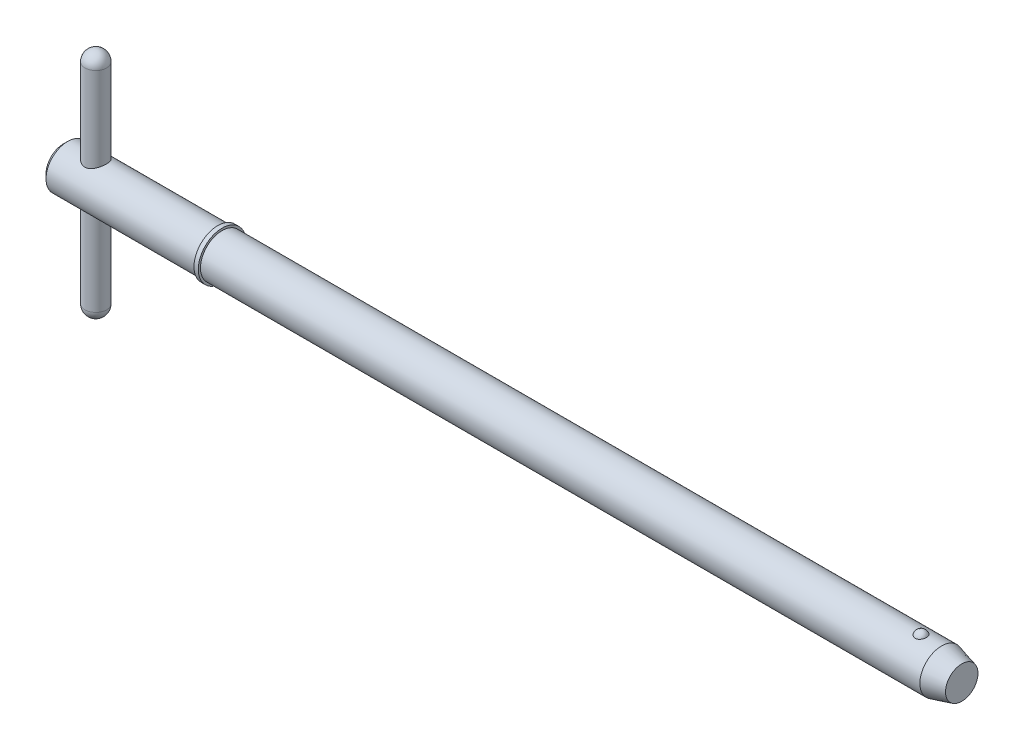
ISO-10303-21;
HEADER;
FILE_DESCRIPTION(('STEP AP214'),'2;1');
FILE_NAME('part.step','',(''),(''),'','','');
FILE_SCHEMA(('AUTOMOTIVE_DESIGN { 1 0 10303 214 1 1 1 1 }'));
ENDSEC;
DATA;
#1=APPLICATION_CONTEXT('core data for automotive mechanical design processes');
#2=APPLICATION_PROTOCOL_DEFINITION('international standard','automotive_design',2000,#1);
#3=PRODUCT_CONTEXT('',#1,'mechanical');
#4=PRODUCT('Part','Part','',(#3));
#5=PRODUCT_RELATED_PRODUCT_CATEGORY('part','',(#4));
#6=PRODUCT_DEFINITION_FORMATION('','',#4);
#7=PRODUCT_DEFINITION_CONTEXT('part definition',#1,'design');
#8=PRODUCT_DEFINITION('design','',#6,#7);
#9=PRODUCT_DEFINITION_SHAPE('','',#8);
#10=(LENGTH_UNIT() NAMED_UNIT(*) SI_UNIT(.MILLI.,.METRE.));
#11=(NAMED_UNIT(*) PLANE_ANGLE_UNIT() SI_UNIT($,.RADIAN.));
#12=(NAMED_UNIT(*) SI_UNIT($,.STERADIAN.) SOLID_ANGLE_UNIT());
#13=UNCERTAINTY_MEASURE_WITH_UNIT(LENGTH_MEASURE(1.E-05),#10,'distance_accuracy_value','');
#14=(GEOMETRIC_REPRESENTATION_CONTEXT(3) GLOBAL_UNCERTAINTY_ASSIGNED_CONTEXT((#13)) GLOBAL_UNIT_ASSIGNED_CONTEXT((#10,
#11,#12)) REPRESENTATION_CONTEXT('',''));
#15=CARTESIAN_POINT('',(0.,0.,0.));
#16=DIRECTION('',(0.,0.,1.));
#17=DIRECTION('',(1.,0.,0.));
#18=AXIS2_PLACEMENT_3D('',#15,#16,#17);
#19=CARTESIAN_POINT('',(3.57,12.7,0.));
#20=DIRECTION('',(0.,-1.,0.));
#21=DIRECTION('',(0.,0.,-1.));
#22=AXIS2_PLACEMENT_3D('',#19,#20,#21);
#23=CYLINDRICAL_SURFACE('',#22,1.19);
#24=CARTESIAN_POINT('',(3.57,-11.51,0.));
#25=DIRECTION('',(0.,-1.,0.));
#26=DIRECTION('',(0.,0.,-1.));
#27=AXIS2_PLACEMENT_3D('',#24,#25,#26);
#28=CIRCLE('',#27,1.19);
#29=CARTESIAN_POINT('',(3.57,-11.51,-1.19));
#30=VERTEX_POINT('',#29);
#31=EDGE_CURVE('P0_E10',#30,#30,#28,.F.);
#32=ORIENTED_EDGE('',*,*,#31,.T.);
#33=EDGE_LOOP('',(#32));
#34=FACE_BOUND('',#33,.T.);
#35=CARTESIAN_POINT('',(3.57,11.51,0.));
#36=DIRECTION('',(0.,-1.,0.));
#37=DIRECTION('',(0.,0.,-1.));
#38=AXIS2_PLACEMENT_3D('',#35,#36,#37);
#39=CIRCLE('',#38,1.19);
#40=CARTESIAN_POINT('',(3.57,11.51,-1.19));
#41=VERTEX_POINT('',#40);
#42=EDGE_CURVE('P0_E21',#41,#41,#39,.T.);
#43=ORIENTED_EDGE('',*,*,#42,.T.);
#44=EDGE_LOOP('',(#43));
#45=FACE_BOUND('',#44,.T.);
#46=ADVANCED_FACE('P0_F14',(#34,#45),#23,.T.);
#47=CARTESIAN_POINT('',(3.57,-11.51,0.));
#48=DIRECTION('',(0.,0.,1.));
#49=DIRECTION('',(1.,0.,0.));
#50=AXIS2_PLACEMENT_3D('',#47,#48,#49);
#51=SPHERICAL_SURFACE('',#50,1.19);
#52=CARTESIAN_POINT('',(3.57,-11.51,0.));
#53=DIRECTION('',(0.,-1.,0.));
#54=DIRECTION('',(0.,0.,-1.));
#55=AXIS2_PLACEMENT_3D('',#52,#53,#54);
#56=SPHERICAL_SURFACE('',#55,1.19);
#57=ORIENTED_EDGE('',*,*,#31,.F.);
#58=EDGE_LOOP('',(#57));
#59=FACE_BOUND('',#58,.T.);
#60=ADVANCED_FACE('P0_F29',(#59),#56,.T.);
#61=CARTESIAN_POINT('',(3.57,11.51,0.));
#62=DIRECTION('',(0.,0.,1.));
#63=DIRECTION('',(1.,0.,0.));
#64=AXIS2_PLACEMENT_3D('',#61,#62,#63);
#65=SPHERICAL_SURFACE('',#64,1.19);
#66=CARTESIAN_POINT('',(3.57,11.51,0.));
#67=DIRECTION('',(0.,-1.,0.));
#68=DIRECTION('',(0.,0.,-1.));
#69=AXIS2_PLACEMENT_3D('',#66,#67,#68);
#70=SPHERICAL_SURFACE('',#69,1.19);
#71=ORIENTED_EDGE('',*,*,#42,.F.);
#72=EDGE_LOOP('',(#71));
#73=FACE_BOUND('',#72,.T.);
#74=ADVANCED_FACE('P0_F16',(#73),#70,.T.);
#75=CLOSED_SHELL('',(#46,#60,#74));
#76=MANIFOLD_SOLID_BREP('P0_B1',#75);
#77=CARTESIAN_POINT('',(0.,0.,0.));
#78=DIRECTION('',(1.,0.,0.));
#79=DIRECTION('',(0.,0.,-1.));
#80=AXIS2_PLACEMENT_3D('',#77,#78,#79);
#81=CYLINDRICAL_SURFACE('',#80,2.38);
#82=CARTESIAN_POINT('',(96.5094297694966,0.,0.));
#83=DIRECTION('',(1.,0.,0.));
#84=DIRECTION('',(0.,0.,-1.));
#85=AXIS2_PLACEMENT_3D('',#82,#83,#84);
#86=CIRCLE('',#85,2.38);
#87=CARTESIAN_POINT('',(96.5094297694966,0.,-2.38));
#88=VERTEX_POINT('',#87);
#89=EDGE_CURVE('P1_E81',#88,#88,#86,.T.);
#90=ORIENTED_EDGE('',*,*,#89,.F.);
#91=EDGE_LOOP('',(#90));
#92=FACE_BOUND('',#91,.T.);
#93=CARTESIAN_POINT('',(17.45,0.,0.));
#94=DIRECTION('',(1.,0.,0.));
#95=DIRECTION('',(0.,0.,-1.));
#96=AXIS2_PLACEMENT_3D('',#93,#94,#95);
#97=CIRCLE('',#96,2.38);
#98=CARTESIAN_POINT('',(17.45,0.,-2.38));
#99=VERTEX_POINT('',#98);
#100=EDGE_CURVE('P1_E85',#99,#99,#97,.T.);
#101=ORIENTED_EDGE('',*,*,#100,.T.);
#102=EDGE_LOOP('',(#101));
#103=FACE_BOUND('',#102,.T.);
#104=CARTESIAN_POINT('',(94.2634492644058,2.2921568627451,0.640637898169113));
#105=CARTESIAN_POINT('',(94.2303559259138,2.29215737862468,0.64063719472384));
#106=CARTESIAN_POINT('',(94.1972546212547,2.29293179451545,0.637884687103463));
#107=CARTESIAN_POINT('',(94.1320176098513,2.29594030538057,0.626968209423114));
#108=CARTESIAN_POINT('',(94.0998823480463,2.29817506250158,0.618801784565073));
#109=CARTESIAN_POINT('',(94.0375402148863,2.3038430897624,0.597351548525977));
#110=CARTESIAN_POINT('',(94.0073305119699,2.30727454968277,0.584075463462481));
#111=CARTESIAN_POINT('',(93.9495674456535,2.31495941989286,0.552829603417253));
#112=CARTESIAN_POINT('',(93.9220141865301,2.31921286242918,0.534859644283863));
#113=CARTESIAN_POINT('',(93.8695938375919,2.32820213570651,0.494282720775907));
#114=CARTESIAN_POINT('',(93.8448050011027,2.33294694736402,0.471576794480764));
#115=CARTESIAN_POINT('',(93.7992169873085,2.34234144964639,0.422446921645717));
#116=CARTESIAN_POINT('',(93.7784185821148,2.34699112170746,0.396022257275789));
#117=CARTESIAN_POINT('',(93.7403580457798,2.35593942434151,0.338855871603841));
#118=CARTESIAN_POINT('',(93.7233051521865,2.36021170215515,0.307970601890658));
#119=CARTESIAN_POINT('',(93.6943607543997,2.3677057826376,0.243750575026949));
#120=CARTESIAN_POINT('',(93.6824701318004,2.37092740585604,0.210415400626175));
#121=CARTESIAN_POINT('',(93.6638076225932,2.37606901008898,0.141189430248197));
#122=CARTESIAN_POINT('',(93.6571956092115,2.37794816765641,0.105252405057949));
#123=CARTESIAN_POINT('',(93.6498095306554,2.38005135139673,0.032735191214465));
#124=CARTESIAN_POINT('',(93.6490358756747,2.38027526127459,-0.00384504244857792));
#125=CARTESIAN_POINT('',(93.6533628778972,2.37903842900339,-0.0769838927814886));
#126=CARTESIAN_POINT('',(93.6585202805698,2.37756141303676,-0.113538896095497));
#127=CARTESIAN_POINT('',(93.6747013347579,2.37305303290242,-0.185229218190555));
#128=CARTESIAN_POINT('',(93.6857251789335,2.37002161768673,-0.220364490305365));
#129=CARTESIAN_POINT('',(93.7133977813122,2.36273722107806,-0.288156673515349));
#130=CARTESIAN_POINT('',(93.7300389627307,2.35848588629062,-0.320816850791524));
#131=CARTESIAN_POINT('',(93.7685984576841,2.34923130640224,-0.382744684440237));
#132=CARTESIAN_POINT('',(93.790516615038,2.34422808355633,-0.412012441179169));
#133=CARTESIAN_POINT('',(93.8387549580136,2.33412555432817,-0.465830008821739));
#134=CARTESIAN_POINT('',(93.8650028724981,2.32902887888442,-0.490444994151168));
#135=CARTESIAN_POINT('',(93.9214769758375,2.31926941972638,-0.534700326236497));
#136=CARTESIAN_POINT('',(93.9517022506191,2.3146065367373,-0.554341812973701));
#137=CARTESIAN_POINT('',(94.0140618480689,2.30645675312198,-0.587312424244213));
#138=CARTESIAN_POINT('',(94.0460780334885,2.30293152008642,-0.600855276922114));
#139=CARTESIAN_POINT('',(94.1120795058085,2.29725171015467,-0.622220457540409));
#140=CARTESIAN_POINT('',(94.1460641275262,2.29509667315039,-0.630044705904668));
#141=CARTESIAN_POINT('',(94.213299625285,2.29249264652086,-0.639452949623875));
#142=CARTESIAN_POINT('',(94.2465087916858,2.29196755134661,-0.641315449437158));
#143=CARTESIAN_POINT('',(94.312763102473,2.29246849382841,-0.63952261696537));
#144=CARTESIAN_POINT('',(94.3458082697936,2.29349430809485,-0.635868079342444));
#145=CARTESIAN_POINT('',(94.4101025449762,2.29694059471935,-0.623301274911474));
#146=CARTESIAN_POINT('',(94.4413744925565,2.29933234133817,-0.614497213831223));
#147=CARTESIAN_POINT('',(94.5019952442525,2.30522511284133,-0.592006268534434));
#148=CARTESIAN_POINT('',(94.5313438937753,2.30872622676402,-0.578318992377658));
#149=CARTESIAN_POINT('',(94.5880369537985,2.31655795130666,-0.546112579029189));
#150=CARTESIAN_POINT('',(94.615320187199,2.32090569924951,-0.52749010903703));
#151=CARTESIAN_POINT('',(94.6664904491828,2.3299220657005,-0.486117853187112));
#152=CARTESIAN_POINT('',(94.6903767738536,2.33459075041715,-0.463367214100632));
#153=CARTESIAN_POINT('',(94.7352722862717,2.34399834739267,-0.41322006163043));
#154=CARTESIAN_POINT('',(94.7560972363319,2.34873051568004,-0.38565730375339));
#155=CARTESIAN_POINT('',(94.793056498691,2.35754932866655,-0.327455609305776));
#156=CARTESIAN_POINT('',(94.8091898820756,2.36163584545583,-0.296816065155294));
#157=CARTESIAN_POINT('',(94.8369822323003,2.36889321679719,-0.232047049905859));
#158=CARTESIAN_POINT('',(94.8484450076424,2.37202275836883,-0.197828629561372));
#159=CARTESIAN_POINT('',(94.8657523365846,2.37681926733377,-0.127900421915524));
#160=CARTESIAN_POINT('',(94.8715962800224,2.37848607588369,-0.092190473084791));
#161=CARTESIAN_POINT('',(94.877605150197,2.38020024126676,-0.0196348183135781));
#162=CARTESIAN_POINT('',(94.8776704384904,2.38021918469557,0.0172198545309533));
#163=CARTESIAN_POINT('',(94.8718689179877,2.37856356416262,0.0904219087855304));
#164=CARTESIAN_POINT('',(94.8660018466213,2.37688892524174,0.126769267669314));
#165=CARTESIAN_POINT('',(94.848425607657,2.37201688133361,0.198028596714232));
#166=CARTESIAN_POINT('',(94.8366998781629,2.36881516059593,0.232936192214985));
#167=CARTESIAN_POINT('',(94.8076354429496,2.36123444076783,0.300196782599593));
#168=CARTESIAN_POINT('',(94.7902967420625,2.3568554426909,0.332549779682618));
#169=CARTESIAN_POINT('',(94.7505350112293,2.34744667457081,0.39349541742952));
#170=CARTESIAN_POINT('',(94.7281528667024,2.34242227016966,0.422115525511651));
#171=CARTESIAN_POINT('',(94.6787391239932,2.33227293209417,0.475004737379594));
#172=CARTESIAN_POINT('',(94.6517076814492,2.32714800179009,0.499273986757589));
#173=CARTESIAN_POINT('',(94.5944988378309,2.31755359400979,0.542046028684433));
#174=CARTESIAN_POINT('',(94.5644297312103,2.3130698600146,0.560690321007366));
#175=CARTESIAN_POINT('',(94.5013869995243,2.30514125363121,0.592447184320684));
#176=CARTESIAN_POINT('',(94.4684158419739,2.30169550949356,0.605564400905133));
#177=CARTESIAN_POINT('',(94.4068424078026,2.29677744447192,0.623927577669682));
#178=CARTESIAN_POINT('',(94.3785555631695,2.295058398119,0.630178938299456));
#179=CARTESIAN_POINT('',(94.3213308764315,2.29274795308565,0.638534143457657));
#180=CARTESIAN_POINT('',(94.2923931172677,2.29215641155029,0.640638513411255));
#181=CARTESIAN_POINT('',(94.2634492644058,2.2921568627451,0.640637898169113));
#182=B_SPLINE_CURVE_WITH_KNOTS('',3,(#104,#105,#106,#107,#108,#109,#110,#111,#112,#113,#114,
#115,#116,#117,#118,#119,#120,#121,#122,#123,#124,#125,#126,#127,#128,#129,#130,#131,#132,#133,
#134,#135,#136,#137,#138,#139,#140,#141,#142,#143,#144,#145,#146,#147,#148,#149,#150,#151,#152,
#153,#154,#155,#156,#157,#158,#159,#160,#161,#162,#163,#164,#165,#166,#167,#168,#169,#170,#171,
#172,#173,#174,#175,#176,#177,#178,#179,#180,#181),.UNSPECIFIED.,.T.,.F.,(4,2,2,2,2,2,2,2,2,2,2,
2,2,2,2,2,2,2,2,2,2,2,2,2,2,2,2,2,2,2,2,2,2,2,2,2,2,2,4),(0.,0.0991724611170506,
0.198389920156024,0.297457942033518,0.396529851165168,0.497927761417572,0.59934527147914,
0.70547553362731,0.811623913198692,0.920876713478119,1.03013718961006,1.14045177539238,
1.25076998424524,1.36093998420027,1.47110672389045,1.57959248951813,1.68805336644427,
1.79234266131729,1.89659691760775,1.9959039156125,2.09519661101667,2.19247425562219,
2.2897597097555,2.38926978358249,2.48880044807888,2.59293588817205,2.69709193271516,
2.80525821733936,2.91343624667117,3.0234791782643,3.13352698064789,3.24388765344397,
3.35424823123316,3.46374443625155,3.5732369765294,3.67968690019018,3.78604717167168,
3.87279565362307,3.9595331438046),.UNSPECIFIED.);
#183=CARTESIAN_POINT('',(94.2634492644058,2.2921568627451,0.640637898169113));
#184=VERTEX_POINT('',#183);
#185=EDGE_CURVE('P1_E35',#184,#184,#182,.T.);
#186=ORIENTED_EDGE('',*,*,#185,.T.);
#187=EDGE_LOOP('',(#186));
#188=FACE_BOUND('',#187,.T.);
#189=ADVANCED_FACE('P1_F13',(#92,#103,#188),#81,.T.);
#190=CARTESIAN_POINT('',(0.,0.,0.));
#191=DIRECTION('',(-1.,0.,0.));
#192=DIRECTION('',(0.,0.,1.));
#193=AXIS2_PLACEMENT_3D('',#190,#191,#192);
#194=PLANE('',#193);
#195=CARTESIAN_POINT('',(0.,0.,0.));
#196=DIRECTION('',(1.,0.,0.));
#197=DIRECTION('',(0.,0.,-1.));
#198=AXIS2_PLACEMENT_3D('',#195,#196,#197);
#199=CIRCLE('',#198,1.904);
#200=CARTESIAN_POINT('',(0.,0.,-1.904));
#201=VERTEX_POINT('',#200);
#202=EDGE_CURVE('P1_E9',#201,#201,#199,.T.);
#203=ORIENTED_EDGE('',*,*,#202,.F.);
#204=EDGE_LOOP('',(#203));
#205=FACE_BOUND('',#204,.T.);
#206=ADVANCED_FACE('P1_F15',(#205),#194,.T.);
#207=CARTESIAN_POINT('',(0.475999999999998,0.,0.));
#208=DIRECTION('',(1.,0.,0.));
#209=DIRECTION('',(0.,0.,-1.));
#210=AXIS2_PLACEMENT_3D('',#207,#208,#209);
#211=CONICAL_SURFACE('',#210,2.38,0.78539816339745);
#212=ORIENTED_EDGE('',*,*,#202,.T.);
#213=EDGE_LOOP('',(#212));
#214=FACE_BOUND('',#213,.T.);
#215=CARTESIAN_POINT('',(0.475999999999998,0.,0.));
#216=DIRECTION('',(1.,0.,0.));
#217=DIRECTION('',(0.,0.,-1.));
#218=AXIS2_PLACEMENT_3D('',#215,#216,#217);
#219=CIRCLE('',#218,2.38);
#220=CARTESIAN_POINT('',(0.475999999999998,0.,-2.38));
#221=VERTEX_POINT('',#220);
#222=EDGE_CURVE('P1_E26',#221,#221,#219,.T.);
#223=ORIENTED_EDGE('',*,*,#222,.F.);
#224=EDGE_LOOP('',(#223));
#225=FACE_BOUND('',#224,.T.);
#226=ADVANCED_FACE('P1_F77',(#214,#225),#211,.T.);
#227=CARTESIAN_POINT('',(0.,0.,0.));
#228=DIRECTION('',(1.,0.,0.));
#229=DIRECTION('',(0.,0.,-1.));
#230=AXIS2_PLACEMENT_3D('',#227,#228,#229);
#231=CYLINDRICAL_SURFACE('',#230,2.38);
#232=CARTESIAN_POINT('',(3.57,-2.06114046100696,1.19));
#233=CARTESIAN_POINT('',(3.50799170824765,-2.06114586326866,1.18999567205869));
#234=CARTESIAN_POINT('',(3.4459051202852,-2.0639812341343,1.18512096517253));
#235=CARTESIAN_POINT('',(3.32363755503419,-2.07491216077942,1.16587061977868));
#236=CARTESIAN_POINT('',(3.26346086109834,-2.08301876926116,1.15147501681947));
#237=CARTESIAN_POINT('',(3.14701251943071,-2.10331722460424,1.11395893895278));
#238=CARTESIAN_POINT('',(3.09072196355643,-2.1154873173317,1.09088484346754));
#239=CARTESIAN_POINT('',(2.9828251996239,-2.14250771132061,1.03680835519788));
#240=CARTESIAN_POINT('',(2.93121924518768,-2.15735815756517,1.00580553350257));
#241=CARTESIAN_POINT('',(2.82945618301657,-2.18956274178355,0.933753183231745));
#242=CARTESIAN_POINT('',(2.77976962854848,-2.20702235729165,0.892085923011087));
#243=CARTESIAN_POINT('',(2.68772401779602,-2.2416265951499,0.801172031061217));
#244=CARTESIAN_POINT('',(2.64536861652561,-2.25877105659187,0.751921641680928));
#245=CARTESIAN_POINT('',(2.56639309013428,-2.29219557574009,0.64318258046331));
#246=CARTESIAN_POINT('',(2.53035201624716,-2.30833946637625,0.583227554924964));
#247=CARTESIAN_POINT('',(2.46908238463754,-2.3365739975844,0.45714686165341));
#248=CARTESIAN_POINT('',(2.44384700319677,-2.34866719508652,0.391025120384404));
#249=CARTESIAN_POINT('',(2.40676945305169,-2.36667748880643,0.259473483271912));
#250=CARTESIAN_POINT('',(2.39410206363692,-2.37297281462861,0.194329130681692));
#251=CARTESIAN_POINT('',(2.3798023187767,-2.3800902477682,0.0625590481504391));
#252=CARTESIAN_POINT('',(2.37816328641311,-2.38091566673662,-0.00406576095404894));
#253=CARTESIAN_POINT('',(2.38564854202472,-2.37717948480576,-0.130700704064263));
#254=CARTESIAN_POINT('',(2.39384923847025,-2.37308010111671,-0.190782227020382));
#255=CARTESIAN_POINT('',(2.41912820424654,-2.360653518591,-0.308583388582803));
#256=CARTESIAN_POINT('',(2.43620713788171,-2.35232600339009,-0.366302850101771));
#257=CARTESIAN_POINT('',(2.47886825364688,-2.33206184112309,-0.478748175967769));
#258=CARTESIAN_POINT('',(2.50456481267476,-2.32007685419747,-0.533421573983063));
#259=CARTESIAN_POINT('',(2.56357346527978,-2.29357798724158,-0.637812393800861));
#260=CARTESIAN_POINT('',(2.5968882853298,-2.27906320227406,-0.687528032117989));
#261=CARTESIAN_POINT('',(2.67380546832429,-2.24724829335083,-0.785606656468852));
#262=CARTESIAN_POINT('',(2.71808260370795,-2.22981457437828,-0.833397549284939));
#263=CARTESIAN_POINT('',(2.81386177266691,-2.19500665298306,-0.921184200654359));
#264=CARTESIAN_POINT('',(2.86536931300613,-2.17763250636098,-0.961173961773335));
#265=CARTESIAN_POINT('',(2.97815134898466,-2.14371545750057,-1.03471134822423));
#266=CARTESIAN_POINT('',(3.03983836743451,-2.12729540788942,-1.06768860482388));
#267=CARTESIAN_POINT('',(3.16889582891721,-2.09886785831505,-1.12254974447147));
#268=CARTESIAN_POINT('',(3.2362602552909,-2.0868557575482,-1.14444520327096));
#269=CARTESIAN_POINT('',(3.36914526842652,-2.06994116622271,-1.1747444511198));
#270=CARTESIAN_POINT('',(3.43438893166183,-2.06455070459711,-1.18407989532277));
#271=CARTESIAN_POINT('',(3.56571759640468,-2.06010324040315,-1.1918051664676));
#272=CARTESIAN_POINT('',(3.63180197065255,-2.06104176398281,-1.19020272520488));
#273=CARTESIAN_POINT('',(3.75522816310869,-2.06862860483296,-1.17695289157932));
#274=CARTESIAN_POINT('',(3.81273554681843,-2.07464109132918,-1.16642350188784));
#275=CARTESIAN_POINT('',(3.92505766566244,-2.09075885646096,-1.1372785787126));
#276=CARTESIAN_POINT('',(3.97987152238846,-2.1008654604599,-1.1186604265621));
#277=CARTESIAN_POINT('',(4.08813948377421,-2.12458104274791,-1.07296063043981));
#278=CARTESIAN_POINT('',(4.14141303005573,-2.13833055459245,-1.04552693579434));
#279=CARTESIAN_POINT('',(4.2429084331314,-2.16765782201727,-0.983281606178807));
#280=CARTESIAN_POINT('',(4.29112767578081,-2.18323651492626,-0.948466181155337));
#281=CARTESIAN_POINT('',(4.38750473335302,-2.2168271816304,-0.867316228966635));
#282=CARTESIAN_POINT('',(4.43488860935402,-2.23489833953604,-0.82008287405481));
#283=CARTESIAN_POINT('',(4.52130056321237,-2.26973739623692,-0.718051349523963));
#284=CARTESIAN_POINT('',(4.56032581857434,-2.28650485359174,-0.663250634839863));
#285=CARTESIAN_POINT('',(4.62978273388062,-2.31742220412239,-0.545657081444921));
#286=CARTESIAN_POINT('',(4.65996041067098,-2.33149133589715,-0.482691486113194));
#287=CARTESIAN_POINT('',(4.7089941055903,-2.35481192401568,-0.351671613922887));
#288=CARTESIAN_POINT('',(4.7278600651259,-2.36406760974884,-0.283621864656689));
#289=CARTESIAN_POINT('',(4.75210859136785,-2.3760433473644,-0.151105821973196));
#290=CARTESIAN_POINT('',(4.75856947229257,-2.37928514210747,-0.0868836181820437));
#291=CARTESIAN_POINT('',(4.76100348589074,-2.38050135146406,0.0417999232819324));
#292=CARTESIAN_POINT('',(4.75698028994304,-2.37847760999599,0.106261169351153));
#293=CARTESIAN_POINT('',(4.73927447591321,-2.36969422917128,0.229120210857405));
#294=CARTESIAN_POINT('',(4.72624582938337,-2.36325544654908,0.287637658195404));
#295=CARTESIAN_POINT('',(4.69178087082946,-2.34658591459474,0.401560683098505));
#296=CARTESIAN_POINT('',(4.67034335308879,-2.33635462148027,0.456965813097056));
#297=CARTESIAN_POINT('',(4.61871480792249,-2.31247857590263,0.565753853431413));
#298=CARTESIAN_POINT('',(4.58818860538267,-2.29870654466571,0.618948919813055));
#299=CARTESIAN_POINT('',(4.51967006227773,-2.26918878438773,0.719681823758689));
#300=CARTESIAN_POINT('',(4.48167429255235,-2.25344215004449,0.76721704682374));
#301=CARTESIAN_POINT('',(4.39491140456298,-2.21969046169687,0.860267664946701));
#302=CARTESIAN_POINT('',(4.34544863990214,-2.20161660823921,0.905111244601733));
#303=CARTESIAN_POINT('',(4.23943364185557,-2.16655060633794,0.986109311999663));
#304=CARTESIAN_POINT('',(4.18287520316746,-2.1495594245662,1.02225611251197));
#305=CARTESIAN_POINT('',(4.06190239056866,-2.1181953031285,1.08579298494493));
#306=CARTESIAN_POINT('',(3.9972962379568,-2.10392207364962,1.11287022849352));
#307=CARTESIAN_POINT('',(3.86353443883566,-2.08090726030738,1.15534566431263));
#308=CARTESIAN_POINT('',(3.7943948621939,-2.07214719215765,1.17078291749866));
#309=CARTESIAN_POINT('',(3.69875162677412,-2.06499834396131,1.18329673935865));
#310=CARTESIAN_POINT('',(3.67309220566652,-2.06355673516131,1.18580656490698));
#311=CARTESIAN_POINT('',(3.62162638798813,-2.06162663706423,1.18915915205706));
#312=CARTESIAN_POINT('',(3.59581998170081,-2.0611382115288,1.19000180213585));
#313=CARTESIAN_POINT('',(3.57,-2.06114046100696,1.19));
#314=B_SPLINE_CURVE_WITH_KNOTS('',3,(#232,#233,#234,#235,#236,#237,#238,#239,#240,#241,#242,
#243,#244,#245,#246,#247,#248,#249,#250,#251,#252,#253,#254,#255,#256,#257,#258,#259,#260,#261,
#262,#263,#264,#265,#266,#267,#268,#269,#270,#271,#272,#273,#274,#275,#276,#277,#278,#279,#280,
#281,#282,#283,#284,#285,#286,#287,#288,#289,#290,#291,#292,#293,#294,#295,#296,#297,#298,#299,
#300,#301,#302,#303,#304,#305,#306,#307,#308,#309,#310,#311,#312,#313),.UNSPECIFIED.,.T.,.F.,(4,
2,2,2,2,2,2,2,2,2,2,2,2,2,2,2,2,2,2,2,2,2,2,2,2,2,2,2,2,2,2,2,2,2,2,2,2,2,2,2,4),(0.,
0.185916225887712,0.372223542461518,0.557549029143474,0.742884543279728,0.943506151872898,
1.14422749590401,1.35847891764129,1.5725948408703,1.77147547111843,1.97023568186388,
2.15171156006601,2.33320101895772,2.51720146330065,2.70126786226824,2.902733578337,
3.10435357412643,3.31877721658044,3.53297641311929,3.73020126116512,3.92728670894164,
4.1028127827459,4.27839572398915,4.46211082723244,4.64592048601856,4.8529002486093,
5.0599497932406,5.27246375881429,5.48479067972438,5.67763601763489,5.87041383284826,
6.05048865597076,6.23058930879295,6.41839293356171,6.60628297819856,6.8128718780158,
7.01964271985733,7.2329479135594,7.44553408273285,7.52294360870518,7.60035831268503),.UNSPECIFIED.);
#315=CARTESIAN_POINT('',(3.57,-2.06114046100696,1.19));
#316=VERTEX_POINT('',#315);
#317=EDGE_CURVE('P1_E17',#316,#316,#314,.T.);
#318=ORIENTED_EDGE('',*,*,#317,.F.);
#319=EDGE_LOOP('',(#318));
#320=FACE_BOUND('',#319,.T.);
#321=CARTESIAN_POINT('',(3.57,2.06114046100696,1.19));
#322=CARTESIAN_POINT('',(3.63200829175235,2.06114586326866,1.18999567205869));
#323=CARTESIAN_POINT('',(3.6940948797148,2.0639812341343,1.18512096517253));
#324=CARTESIAN_POINT('',(3.81636244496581,2.07491216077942,1.16587061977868));
#325=CARTESIAN_POINT('',(3.87653913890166,2.08301876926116,1.15147501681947));
#326=CARTESIAN_POINT('',(3.99298748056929,2.10331722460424,1.11395893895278));
#327=CARTESIAN_POINT('',(4.04927803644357,2.1154873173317,1.09088484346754));
#328=CARTESIAN_POINT('',(4.1571748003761,2.14250771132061,1.03680835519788));
#329=CARTESIAN_POINT('',(4.20878075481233,2.15735815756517,1.00580553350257));
#330=CARTESIAN_POINT('',(4.31054381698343,2.18956274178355,0.933753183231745));
#331=CARTESIAN_POINT('',(4.36023037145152,2.20702235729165,0.892085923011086));
#332=CARTESIAN_POINT('',(4.45227598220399,2.2416265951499,0.801172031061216));
#333=CARTESIAN_POINT('',(4.49463138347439,2.25877105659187,0.751921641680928));
#334=CARTESIAN_POINT('',(4.57360690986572,2.29219557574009,0.643182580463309));
#335=CARTESIAN_POINT('',(4.60964798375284,2.30833946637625,0.583227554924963));
#336=CARTESIAN_POINT('',(4.67091761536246,2.3365739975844,0.457146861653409));
#337=CARTESIAN_POINT('',(4.69615299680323,2.34866719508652,0.391025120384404));
#338=CARTESIAN_POINT('',(4.73323054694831,2.36667748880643,0.259473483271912));
#339=CARTESIAN_POINT('',(4.74589793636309,2.37297281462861,0.194329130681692));
#340=CARTESIAN_POINT('',(4.7601976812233,2.3800902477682,0.0625590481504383));
#341=CARTESIAN_POINT('',(4.76183671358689,2.38091566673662,-0.00406576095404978));
#342=CARTESIAN_POINT('',(4.75435145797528,2.37717948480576,-0.130700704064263));
#343=CARTESIAN_POINT('',(4.74615076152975,2.37308010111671,-0.190782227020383));
#344=CARTESIAN_POINT('',(4.72087179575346,2.360653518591,-0.308583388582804));
#345=CARTESIAN_POINT('',(4.70379286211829,2.35232600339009,-0.366302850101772));
#346=CARTESIAN_POINT('',(4.66113174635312,2.33206184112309,-0.478748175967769));
#347=CARTESIAN_POINT('',(4.63543518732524,2.32007685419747,-0.533421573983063));
#348=CARTESIAN_POINT('',(4.57642653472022,2.29357798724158,-0.637812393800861));
#349=CARTESIAN_POINT('',(4.5431117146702,2.27906320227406,-0.687528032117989));
#350=CARTESIAN_POINT('',(4.46619453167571,2.24724829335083,-0.785606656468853));
#351=CARTESIAN_POINT('',(4.42191739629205,2.22981457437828,-0.83339754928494));
#352=CARTESIAN_POINT('',(4.32613822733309,2.19500665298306,-0.921184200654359));
#353=CARTESIAN_POINT('',(4.27463068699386,2.17763250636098,-0.961173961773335));
#354=CARTESIAN_POINT('',(4.16184865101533,2.14371545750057,-1.03471134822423));
#355=CARTESIAN_POINT('',(4.10016163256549,2.12729540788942,-1.06768860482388));
#356=CARTESIAN_POINT('',(3.97110417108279,2.09886785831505,-1.12254974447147));
#357=CARTESIAN_POINT('',(3.9037397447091,2.0868557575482,-1.14444520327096));
#358=CARTESIAN_POINT('',(3.77085473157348,2.06994116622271,-1.1747444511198));
#359=CARTESIAN_POINT('',(3.70561106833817,2.06455070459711,-1.18407989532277));
#360=CARTESIAN_POINT('',(3.57428240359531,2.06010324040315,-1.1918051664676));
#361=CARTESIAN_POINT('',(3.50819802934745,2.06104176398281,-1.19020272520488));
#362=CARTESIAN_POINT('',(3.38477183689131,2.06862860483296,-1.17695289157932));
#363=CARTESIAN_POINT('',(3.32726445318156,2.07464109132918,-1.16642350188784));
#364=CARTESIAN_POINT('',(3.21494233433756,2.09075885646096,-1.1372785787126));
#365=CARTESIAN_POINT('',(3.16012847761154,2.1008654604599,-1.1186604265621));
#366=CARTESIAN_POINT('',(3.05186051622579,2.12458104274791,-1.07296063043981));
#367=CARTESIAN_POINT('',(2.99858696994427,2.13833055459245,-1.04552693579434));
#368=CARTESIAN_POINT('',(2.8970915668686,2.16765782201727,-0.983281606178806));
#369=CARTESIAN_POINT('',(2.84887232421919,2.18323651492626,-0.948466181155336));
#370=CARTESIAN_POINT('',(2.75249526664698,2.2168271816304,-0.867316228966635));
#371=CARTESIAN_POINT('',(2.70511139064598,2.23489833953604,-0.820082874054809));
#372=CARTESIAN_POINT('',(2.61869943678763,2.26973739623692,-0.718051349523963));
#373=CARTESIAN_POINT('',(2.57967418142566,2.28650485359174,-0.663250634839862));
#374=CARTESIAN_POINT('',(2.51021726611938,2.31742220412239,-0.54565708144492));
#375=CARTESIAN_POINT('',(2.48003958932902,2.33149133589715,-0.482691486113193));
#376=CARTESIAN_POINT('',(2.4310058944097,2.35481192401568,-0.351671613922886));
#377=CARTESIAN_POINT('',(2.4121399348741,2.36406760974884,-0.283621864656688));
#378=CARTESIAN_POINT('',(2.38789140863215,2.3760433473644,-0.151105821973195));
#379=CARTESIAN_POINT('',(2.38143052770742,2.37928514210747,-0.0868836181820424));
#380=CARTESIAN_POINT('',(2.37899651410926,2.38050135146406,0.0417999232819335));
#381=CARTESIAN_POINT('',(2.38301971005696,2.37847760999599,0.106261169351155));
#382=CARTESIAN_POINT('',(2.40072552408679,2.36969422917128,0.229120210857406));
#383=CARTESIAN_POINT('',(2.41375417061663,2.36325544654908,0.287637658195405));
#384=CARTESIAN_POINT('',(2.44821912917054,2.34658591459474,0.401560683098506));
#385=CARTESIAN_POINT('',(2.46965664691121,2.33635462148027,0.456965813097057));
#386=CARTESIAN_POINT('',(2.52128519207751,2.31247857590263,0.565753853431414));
#387=CARTESIAN_POINT('',(2.55181139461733,2.29870654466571,0.618948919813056));
#388=CARTESIAN_POINT('',(2.62032993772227,2.26918878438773,0.719681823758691));
#389=CARTESIAN_POINT('',(2.65832570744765,2.25344215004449,0.767217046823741));
#390=CARTESIAN_POINT('',(2.74508859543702,2.21969046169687,0.860267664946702));
#391=CARTESIAN_POINT('',(2.79455136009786,2.20161660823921,0.905111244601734));
#392=CARTESIAN_POINT('',(2.90056635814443,2.16655060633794,0.986109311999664));
#393=CARTESIAN_POINT('',(2.95712479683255,2.1495594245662,1.02225611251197));
#394=CARTESIAN_POINT('',(3.07809760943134,2.1181953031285,1.08579298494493));
#395=CARTESIAN_POINT('',(3.1427037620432,2.10392207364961,1.11287022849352));
#396=CARTESIAN_POINT('',(3.27646556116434,2.08090726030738,1.15534566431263));
#397=CARTESIAN_POINT('',(3.3456051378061,2.07214719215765,1.17078291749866));
#398=CARTESIAN_POINT('',(3.44124837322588,2.06499834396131,1.18329673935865));
#399=CARTESIAN_POINT('',(3.46690779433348,2.06355673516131,1.18580656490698));
#400=CARTESIAN_POINT('',(3.51837361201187,2.06162663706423,1.18915915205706));
#401=CARTESIAN_POINT('',(3.54418001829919,2.0611382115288,1.19000180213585));
#402=CARTESIAN_POINT('',(3.57,2.06114046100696,1.19));
#403=B_SPLINE_CURVE_WITH_KNOTS('',3,(#321,#322,#323,#324,#325,#326,#327,#328,#329,#330,#331,
#332,#333,#334,#335,#336,#337,#338,#339,#340,#341,#342,#343,#344,#345,#346,#347,#348,#349,#350,
#351,#352,#353,#354,#355,#356,#357,#358,#359,#360,#361,#362,#363,#364,#365,#366,#367,#368,#369,
#370,#371,#372,#373,#374,#375,#376,#377,#378,#379,#380,#381,#382,#383,#384,#385,#386,#387,#388,
#389,#390,#391,#392,#393,#394,#395,#396,#397,#398,#399,#400,#401,#402),.UNSPECIFIED.,.T.,.F.,(4,
2,2,2,2,2,2,2,2,2,2,2,2,2,2,2,2,2,2,2,2,2,2,2,2,2,2,2,2,2,2,2,2,2,2,2,2,2,2,2,4),(0.,
0.185916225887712,0.372223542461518,0.557549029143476,0.74288454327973,0.9435061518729,
1.14422749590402,1.35847891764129,1.5725948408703,1.77147547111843,1.97023568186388,
2.15171156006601,2.33320101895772,2.51720146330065,2.70126786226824,2.902733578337,
3.10435357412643,3.31877721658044,3.53297641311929,3.73020126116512,3.92728670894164,
4.1028127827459,4.27839572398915,4.46211082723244,4.64592048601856,4.8529002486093,
5.05994979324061,5.27246375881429,5.48479067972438,5.67763601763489,5.87041383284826,
6.05048865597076,6.23058930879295,6.41839293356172,6.60628297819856,6.8128718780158,
7.01964271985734,7.2329479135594,7.44553408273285,7.52294360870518,7.60035831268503),.UNSPECIFIED.);
#404=CARTESIAN_POINT('',(3.57,2.06114046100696,1.19));
#405=VERTEX_POINT('',#404);
#406=EDGE_CURVE('P1_E43',#405,#405,#403,.T.);
#407=ORIENTED_EDGE('',*,*,#406,.F.);
#408=EDGE_LOOP('',(#407));
#409=FACE_BOUND('',#408,.T.);
#410=ORIENTED_EDGE('',*,*,#222,.T.);
#411=EDGE_LOOP('',(#410));
#412=FACE_BOUND('',#411,.T.);
#413=CARTESIAN_POINT('',(16.974,0.,0.));
#414=DIRECTION('',(1.,0.,0.));
#415=DIRECTION('',(0.,0.,-1.));
#416=AXIS2_PLACEMENT_3D('',#413,#414,#415);
#417=CIRCLE('',#416,2.38);
#418=CARTESIAN_POINT('',(16.974,0.,-2.38));
#419=VERTEX_POINT('',#418);
#420=EDGE_CURVE('P1_E31',#419,#419,#417,.T.);
#421=ORIENTED_EDGE('',*,*,#420,.F.);
#422=EDGE_LOOP('',(#421));
#423=FACE_BOUND('',#422,.T.);
#424=ADVANCED_FACE('P1_F103',(#320,#409,#412,#423),#231,.T.);
#425=CARTESIAN_POINT('',(16.974,2.38,0.));
#426=DIRECTION('',(-1.,0.,0.));
#427=DIRECTION('',(0.,0.,1.));
#428=AXIS2_PLACEMENT_3D('',#425,#426,#427);
#429=PLANE('',#428);
#430=ORIENTED_EDGE('',*,*,#420,.T.);
#431=EDGE_LOOP('',(#430));
#432=FACE_BOUND('',#431,.T.);
#433=CARTESIAN_POINT('',(16.974,0.,0.));
#434=DIRECTION('',(1.,0.,0.));
#435=DIRECTION('',(0.,0.,-1.));
#436=AXIS2_PLACEMENT_3D('',#433,#434,#435);
#437=CIRCLE('',#436,2.618);
#438=CARTESIAN_POINT('',(16.974,0.,-2.618));
#439=VERTEX_POINT('',#438);
#440=EDGE_CURVE('P1_E91',#439,#439,#437,.T.);
#441=ORIENTED_EDGE('',*,*,#440,.F.);
#442=EDGE_LOOP('',(#441));
#443=FACE_BOUND('',#442,.T.);
#444=ADVANCED_FACE('P1_F100',(#432,#443),#429,.T.);
#445=CARTESIAN_POINT('',(0.,0.,0.));
#446=DIRECTION('',(1.,0.,0.));
#447=DIRECTION('',(0.,0.,-1.));
#448=AXIS2_PLACEMENT_3D('',#445,#446,#447);
#449=CYLINDRICAL_SURFACE('',#448,2.618);
#450=ORIENTED_EDGE('',*,*,#440,.T.);
#451=EDGE_LOOP('',(#450));
#452=FACE_BOUND('',#451,.T.);
#453=CARTESIAN_POINT('',(17.45,0.,0.));
#454=DIRECTION('',(1.,0.,0.));
#455=DIRECTION('',(0.,0.,-1.));
#456=AXIS2_PLACEMENT_3D('',#453,#454,#455);
#457=CIRCLE('',#456,2.618);
#458=CARTESIAN_POINT('',(17.45,0.,-2.618));
#459=VERTEX_POINT('',#458);
#460=EDGE_CURVE('P1_E88',#459,#459,#457,.T.);
#461=ORIENTED_EDGE('',*,*,#460,.F.);
#462=EDGE_LOOP('',(#461));
#463=FACE_BOUND('',#462,.T.);
#464=ADVANCED_FACE('P1_F68',(#452,#463),#449,.T.);
#465=CARTESIAN_POINT('',(17.45,2.618,0.));
#466=DIRECTION('',(1.,0.,0.));
#467=DIRECTION('',(0.,0.,-1.));
#468=AXIS2_PLACEMENT_3D('',#465,#466,#467);
#469=PLANE('',#468);
#470=ORIENTED_EDGE('',*,*,#460,.T.);
#471=EDGE_LOOP('',(#470));
#472=FACE_BOUND('',#471,.T.);
#473=ORIENTED_EDGE('',*,*,#100,.F.);
#474=EDGE_LOOP('',(#473));
#475=FACE_BOUND('',#474,.T.);
#476=ADVANCED_FACE('P1_F62',(#472,#475),#469,.T.);
#477=CARTESIAN_POINT('',(98.73,0.,0.));
#478=DIRECTION('',(-1.,0.,0.));
#479=DIRECTION('',(0.,0.,1.));
#480=AXIS2_PLACEMENT_3D('',#477,#478,#479);
#481=CONICAL_SURFACE('',#480,1.78500000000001,0.261799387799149);
#482=ORIENTED_EDGE('',*,*,#89,.T.);
#483=EDGE_LOOP('',(#482));
#484=FACE_BOUND('',#483,.T.);
#485=CARTESIAN_POINT('',(98.73,0.,0.));
#486=DIRECTION('',(1.,0.,0.));
#487=DIRECTION('',(0.,0.,-1.));
#488=AXIS2_PLACEMENT_3D('',#485,#486,#487);
#489=CIRCLE('',#488,1.78500000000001);
#490=CARTESIAN_POINT('',(98.73,0.,-1.78500000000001));
#491=VERTEX_POINT('',#490);
#492=EDGE_CURVE('P1_E42',#491,#491,#489,.T.);
#493=ORIENTED_EDGE('',*,*,#492,.F.);
#494=EDGE_LOOP('',(#493));
#495=FACE_BOUND('',#494,.T.);
#496=ADVANCED_FACE('P1_F59',(#484,#495),#481,.T.);
#497=CARTESIAN_POINT('',(98.73,1.78500000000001,0.));
#498=DIRECTION('',(1.,0.,0.));
#499=DIRECTION('',(0.,0.,-1.));
#500=AXIS2_PLACEMENT_3D('',#497,#498,#499);
#501=PLANE('',#500);
#502=ORIENTED_EDGE('',*,*,#492,.T.);
#503=EDGE_LOOP('',(#502));
#504=FACE_BOUND('',#503,.T.);
#505=ADVANCED_FACE('P1_F55',(#504),#501,.T.);
#506=CARTESIAN_POINT('',(94.2634492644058,2.142,0.));
#507=DIRECTION('',(-1.,0.,0.));
#508=DIRECTION('',(0.,1.,0.));
#509=AXIS2_PLACEMENT_3D('',#506,#507,#508);
#510=SPHERICAL_SURFACE('',#509,0.657999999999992);
#511=ORIENTED_EDGE('',*,*,#185,.F.);
#512=EDGE_LOOP('',(#511));
#513=FACE_BOUND('',#512,.T.);
#514=ADVANCED_FACE('P1_F50',(#513),#510,.T.);
#515=CARTESIAN_POINT('',(3.57,-2.618,0.));
#516=DIRECTION('',(0.,1.,0.));
#517=DIRECTION('',(0.,0.,1.));
#518=AXIS2_PLACEMENT_3D('',#515,#516,#517);
#519=CYLINDRICAL_SURFACE('',#518,1.19);
#520=ORIENTED_EDGE('',*,*,#317,.T.);
#521=EDGE_LOOP('',(#520));
#522=FACE_BOUND('',#521,.T.);
#523=ORIENTED_EDGE('',*,*,#406,.T.);
#524=EDGE_LOOP('',(#523));
#525=FACE_BOUND('',#524,.T.);
#526=ADVANCED_FACE('P1_F54',(#522,#525),#519,.F.);
#527=CLOSED_SHELL('',(#189,#206,#226,#424,#444,#464,#476,#496,#505,#514,#526));
#528=MANIFOLD_SOLID_BREP('P1_B1',#527);
#529=ADVANCED_BREP_SHAPE_REPRESENTATION('',(#18,#76,#528),#14);
#530=SHAPE_DEFINITION_REPRESENTATION(#9,#529);
ENDSEC;
END-ISO-10303-21;
